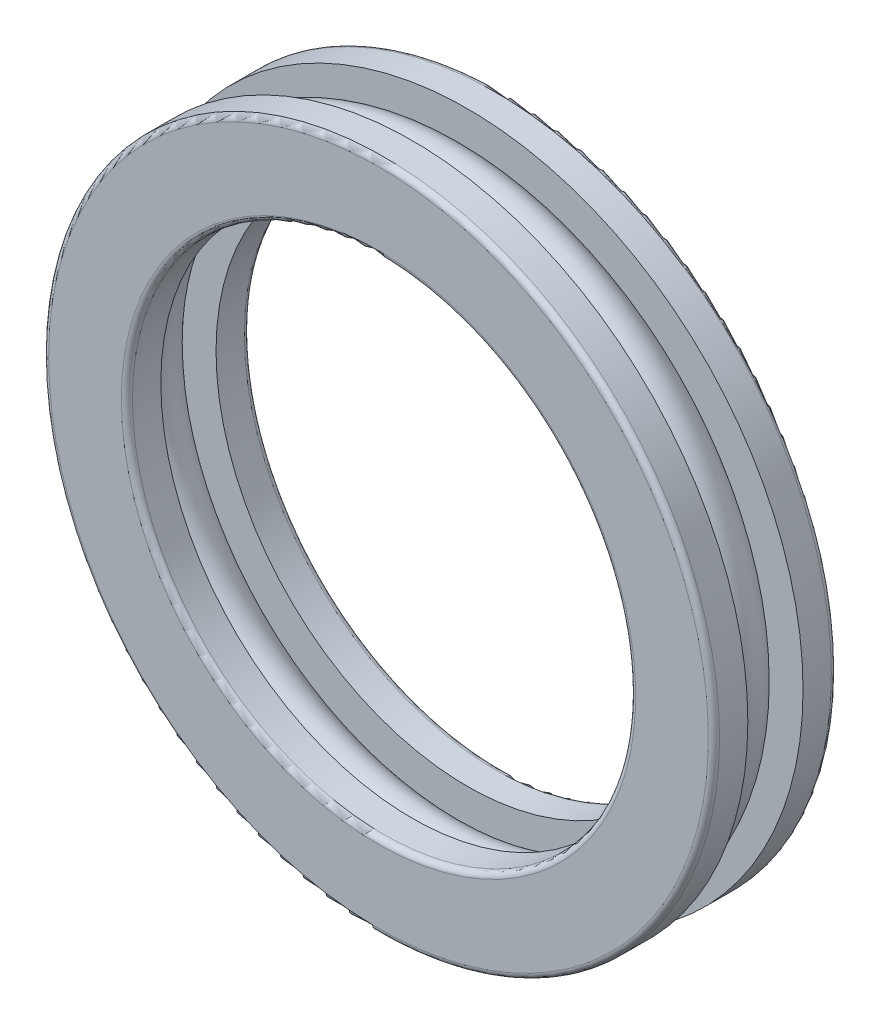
ISO-10303-21;
HEADER;
FILE_DESCRIPTION(('STEP AP214'),'2;1');
FILE_NAME('part.step','',(''),(''),'','','');
FILE_SCHEMA(('AUTOMOTIVE_DESIGN { 1 0 10303 214 1 1 1 1 }'));
ENDSEC;
DATA;
#1=APPLICATION_CONTEXT('core data for automotive mechanical design processes');
#2=APPLICATION_PROTOCOL_DEFINITION('international standard','automotive_design',2000,#1);
#3=PRODUCT_CONTEXT('',#1,'mechanical');
#4=PRODUCT('Part','Part','',(#3));
#5=PRODUCT_RELATED_PRODUCT_CATEGORY('part','',(#4));
#6=PRODUCT_DEFINITION_FORMATION('','',#4);
#7=PRODUCT_DEFINITION_CONTEXT('part definition',#1,'design');
#8=PRODUCT_DEFINITION('design','',#6,#7);
#9=PRODUCT_DEFINITION_SHAPE('','',#8);
#10=(LENGTH_UNIT() NAMED_UNIT(*) SI_UNIT(.MILLI.,.METRE.));
#11=(NAMED_UNIT(*) PLANE_ANGLE_UNIT() SI_UNIT($,.RADIAN.));
#12=(NAMED_UNIT(*) SI_UNIT($,.STERADIAN.) SOLID_ANGLE_UNIT());
#13=UNCERTAINTY_MEASURE_WITH_UNIT(LENGTH_MEASURE(1.E-05),#10,'distance_accuracy_value','');
#14=(GEOMETRIC_REPRESENTATION_CONTEXT(3) GLOBAL_UNCERTAINTY_ASSIGNED_CONTEXT((#13)) GLOBAL_UNIT_ASSIGNED_CONTEXT((#10,
#11,#12)) REPRESENTATION_CONTEXT('',''));
#15=CARTESIAN_POINT('',(0.,0.,0.));
#16=DIRECTION('',(0.,0.,1.));
#17=DIRECTION('',(1.,0.,0.));
#18=AXIS2_PLACEMENT_3D('',#15,#16,#17);
#19=CARTESIAN_POINT('',(0.,0.,-11.));
#20=DIRECTION('',(0.,0.,1.));
#21=DIRECTION('',(1.,0.,0.));
#22=AXIS2_PLACEMENT_3D('',#19,#20,#21);
#23=TOROIDAL_SURFACE('',#22,52.5,4.51903390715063);
#24=CARTESIAN_POINT('',(57.0190339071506,0.,-11.));
#25=VERTEX_POINT('',#24);
#26=VERTEX_LOOP('',#25);
#27=FACE_BOUND('',#26,.T.);
#28=ADVANCED_FACE('F39',(#27),#23,.T.);
#29=CLOSED_SHELL('',(#28));
#30=MANIFOLD_SOLID_BREP('B2',#29);
#31=CARTESIAN_POINT('',(0.,0.,0.));
#32=DIRECTION('',(0.,0.,1.));
#33=DIRECTION('',(1.,0.,0.));
#34=AXIS2_PLACEMENT_3D('',#31,#32,#33);
#35=CYLINDRICAL_SURFACE('',#34,60.);
#36=CARTESIAN_POINT('',(0.,0.,-21.));
#37=DIRECTION('',(0.,0.,1.));
#38=DIRECTION('',(1.,0.,0.));
#39=AXIS2_PLACEMENT_3D('',#36,#37,#38);
#40=CIRCLE('',#39,60.);
#41=CARTESIAN_POINT('',(60.,0.,-21.));
#42=VERTEX_POINT('',#41);
#43=EDGE_CURVE('E38',#42,#42,#40,.T.);
#44=ORIENTED_EDGE('',*,*,#43,.T.);
#45=EDGE_LOOP('',(#44));
#46=FACE_BOUND('',#45,.T.);
#47=CARTESIAN_POINT('',(0.,0.,-15.9376947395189));
#48=DIRECTION('',(0.,0.,1.));
#49=DIRECTION('',(1.,0.,0.));
#50=AXIS2_PLACEMENT_3D('',#47,#48,#49);
#51=CIRCLE('',#50,60.);
#52=CARTESIAN_POINT('',(60.,0.,-15.9376947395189));
#53=VERTEX_POINT('',#52);
#54=EDGE_CURVE('E78',#53,#53,#51,.T.);
#55=ORIENTED_EDGE('',*,*,#54,.F.);
#56=EDGE_LOOP('',(#55));
#57=FACE_BOUND('',#56,.T.);
#58=ADVANCED_FACE('F58',(#46,#57),#35,.T.);
#59=CARTESIAN_POINT('',(-60.,0.,-15.9376947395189));
#60=DIRECTION('',(0.,0.,-1.));
#61=DIRECTION('',(-1.,0.,0.));
#62=AXIS2_PLACEMENT_3D('',#59,#60,#61);
#63=PLANE('',#62);
#64=CARTESIAN_POINT('',(0.,0.,-15.9376947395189));
#65=DIRECTION('',(0.,0.,1.));
#66=DIRECTION('',(1.,0.,0.));
#67=AXIS2_PLACEMENT_3D('',#64,#65,#66);
#68=CIRCLE('',#67,45.);
#69=CARTESIAN_POINT('',(45.,0.,-15.9376947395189));
#70=VERTEX_POINT('',#69);
#71=EDGE_CURVE('E81',#70,#70,#68,.T.);
#72=ORIENTED_EDGE('',*,*,#71,.F.);
#73=EDGE_LOOP('',(#72));
#74=FACE_BOUND('',#73,.T.);
#75=ORIENTED_EDGE('',*,*,#54,.T.);
#76=EDGE_LOOP('',(#75));
#77=FACE_BOUND('',#76,.T.);
#78=ADVANCED_FACE('F87',(#74,#77),#63,.F.);
#79=CARTESIAN_POINT('',(0.,0.,0.));
#80=DIRECTION('',(0.,0.,1.));
#81=DIRECTION('',(1.,0.,0.));
#82=AXIS2_PLACEMENT_3D('',#79,#80,#81);
#83=CYLINDRICAL_SURFACE('',#82,45.);
#84=CARTESIAN_POINT('',(0.,0.,-21.));
#85=DIRECTION('',(0.,0.,1.));
#86=DIRECTION('',(1.,0.,0.));
#87=AXIS2_PLACEMENT_3D('',#84,#85,#86);
#88=CIRCLE('',#87,45.);
#89=CARTESIAN_POINT('',(45.,0.,-21.));
#90=VERTEX_POINT('',#89);
#91=EDGE_CURVE('E65',#90,#90,#88,.F.);
#92=ORIENTED_EDGE('',*,*,#91,.T.);
#93=EDGE_LOOP('',(#92));
#94=FACE_BOUND('',#93,.T.);
#95=ORIENTED_EDGE('',*,*,#71,.T.);
#96=EDGE_LOOP('',(#95));
#97=FACE_BOUND('',#96,.T.);
#98=ADVANCED_FACE('F85',(#94,#97),#83,.F.);
#99=CARTESIAN_POINT('',(-60.,0.,-22.));
#100=DIRECTION('',(0.,0.,1.));
#101=DIRECTION('',(1.,0.,0.));
#102=AXIS2_PLACEMENT_3D('',#99,#100,#101);
#103=PLANE('',#102);
#104=CARTESIAN_POINT('',(0.,0.,-22.));
#105=DIRECTION('',(0.,0.,1.));
#106=DIRECTION('',(1.,0.,0.));
#107=AXIS2_PLACEMENT_3D('',#104,#105,#106);
#108=CIRCLE('',#107,46.);
#109=CARTESIAN_POINT('',(46.,0.,-22.));
#110=VERTEX_POINT('',#109);
#111=EDGE_CURVE('E69',#110,#110,#108,.T.);
#112=ORIENTED_EDGE('',*,*,#111,.T.);
#113=EDGE_LOOP('',(#112));
#114=FACE_BOUND('',#113,.T.);
#115=CARTESIAN_POINT('',(0.,0.,-22.));
#116=DIRECTION('',(0.,0.,1.));
#117=DIRECTION('',(1.,0.,0.));
#118=AXIS2_PLACEMENT_3D('',#115,#116,#117);
#119=CIRCLE('',#118,59.);
#120=CARTESIAN_POINT('',(59.,0.,-22.));
#121=VERTEX_POINT('',#120);
#122=EDGE_CURVE('E73',#121,#121,#119,.F.);
#123=ORIENTED_EDGE('',*,*,#122,.T.);
#124=EDGE_LOOP('',(#123));
#125=FACE_BOUND('',#124,.T.);
#126=ADVANCED_FACE('F100',(#114,#125),#103,.F.);
#127=CARTESIAN_POINT('',(0.,0.,-21.));
#128=DIRECTION('',(0.,0.,1.));
#129=DIRECTION('',(1.,0.,0.));
#130=AXIS2_PLACEMENT_3D('',#127,#128,#129);
#131=TOROIDAL_SURFACE('',#130,46.,1.);
#132=ORIENTED_EDGE('',*,*,#91,.F.);
#133=EDGE_LOOP('',(#132));
#134=FACE_BOUND('',#133,.T.);
#135=ORIENTED_EDGE('',*,*,#111,.F.);
#136=EDGE_LOOP('',(#135));
#137=FACE_BOUND('',#136,.T.);
#138=ADVANCED_FACE('F98',(#134,#137),#131,.T.);
#139=CARTESIAN_POINT('',(0.,0.,-21.));
#140=DIRECTION('',(0.,0.,1.));
#141=DIRECTION('',(1.,0.,0.));
#142=AXIS2_PLACEMENT_3D('',#139,#140,#141);
#143=TOROIDAL_SURFACE('',#142,59.,1.);
#144=ORIENTED_EDGE('',*,*,#122,.F.);
#145=EDGE_LOOP('',(#144));
#146=FACE_BOUND('',#145,.T.);
#147=ORIENTED_EDGE('',*,*,#43,.F.);
#148=EDGE_LOOP('',(#147));
#149=FACE_BOUND('',#148,.T.);
#150=ADVANCED_FACE('F60',(#146,#149),#143,.T.);
#151=CLOSED_SHELL('',(#58,#78,#98,#126,#138,#150));
#152=MANIFOLD_SOLID_BREP('B6',#151);
#153=CARTESIAN_POINT('',(0.,0.,0.));
#154=DIRECTION('',(0.,0.,1.));
#155=DIRECTION('',(1.,0.,0.));
#156=AXIS2_PLACEMENT_3D('',#153,#154,#155);
#157=CYLINDRICAL_SURFACE('',#156,60.);
#158=CARTESIAN_POINT('',(0.,0.,-1.));
#159=DIRECTION('',(0.,0.,-1.));
#160=DIRECTION('',(-1.,0.,0.));
#161=AXIS2_PLACEMENT_3D('',#158,#159,#160);
#162=CIRCLE('',#161,60.);
#163=CARTESIAN_POINT('',(-60.,0.,-1.));
#164=VERTEX_POINT('',#163);
#165=EDGE_CURVE('E156',#164,#164,#162,.T.);
#166=ORIENTED_EDGE('',*,*,#165,.T.);
#167=EDGE_LOOP('',(#166));
#168=FACE_BOUND('',#167,.T.);
#169=CARTESIAN_POINT('',(0.,0.,-6.06230526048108));
#170=DIRECTION('',(0.,0.,1.));
#171=DIRECTION('',(1.,0.,0.));
#172=AXIS2_PLACEMENT_3D('',#169,#170,#171);
#173=CIRCLE('',#172,60.);
#174=CARTESIAN_POINT('',(60.,0.,-6.06230526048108));
#175=VERTEX_POINT('',#174);
#176=EDGE_CURVE('E169',#175,#175,#173,.T.);
#177=ORIENTED_EDGE('',*,*,#176,.T.);
#178=EDGE_LOOP('',(#177));
#179=FACE_BOUND('',#178,.T.);
#180=ADVANCED_FACE('F149',(#168,#179),#157,.T.);
#181=CARTESIAN_POINT('',(-60.,0.,-6.06230526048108));
#182=DIRECTION('',(0.,0.,1.));
#183=DIRECTION('',(1.,0.,0.));
#184=AXIS2_PLACEMENT_3D('',#181,#182,#183);
#185=PLANE('',#184);
#186=ORIENTED_EDGE('',*,*,#176,.F.);
#187=EDGE_LOOP('',(#186));
#188=FACE_BOUND('',#187,.T.);
#189=CARTESIAN_POINT('',(0.,0.,-6.06230526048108));
#190=DIRECTION('',(0.,0.,1.));
#191=DIRECTION('',(1.,0.,0.));
#192=AXIS2_PLACEMENT_3D('',#189,#190,#191);
#193=CIRCLE('',#192,45.);
#194=CARTESIAN_POINT('',(45.,0.,-6.06230526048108));
#195=VERTEX_POINT('',#194);
#196=EDGE_CURVE('E172',#195,#195,#193,.T.);
#197=ORIENTED_EDGE('',*,*,#196,.T.);
#198=EDGE_LOOP('',(#197));
#199=FACE_BOUND('',#198,.T.);
#200=ADVANCED_FACE('F176',(#188,#199),#185,.F.);
#201=CARTESIAN_POINT('',(0.,0.,0.));
#202=DIRECTION('',(0.,0.,1.));
#203=DIRECTION('',(1.,0.,0.));
#204=AXIS2_PLACEMENT_3D('',#201,#202,#203);
#205=CYLINDRICAL_SURFACE('',#204,45.);
#206=CARTESIAN_POINT('',(0.,0.,-1.));
#207=DIRECTION('',(0.,0.,-1.));
#208=DIRECTION('',(-1.,0.,0.));
#209=AXIS2_PLACEMENT_3D('',#206,#207,#208);
#210=CIRCLE('',#209,45.);
#211=CARTESIAN_POINT('',(-45.,0.,-1.));
#212=VERTEX_POINT('',#211);
#213=EDGE_CURVE('E57',#212,#212,#210,.F.);
#214=ORIENTED_EDGE('',*,*,#213,.T.);
#215=EDGE_LOOP('',(#214));
#216=FACE_BOUND('',#215,.T.);
#217=ORIENTED_EDGE('',*,*,#196,.F.);
#218=EDGE_LOOP('',(#217));
#219=FACE_BOUND('',#218,.T.);
#220=ADVANCED_FACE('F178',(#216,#219),#205,.F.);
#221=CARTESIAN_POINT('',(-60.,0.,0.));
#222=DIRECTION('',(0.,0.,-1.));
#223=DIRECTION('',(-1.,0.,0.));
#224=AXIS2_PLACEMENT_3D('',#221,#222,#223);
#225=PLANE('',#224);
#226=CARTESIAN_POINT('',(0.,0.,0.));
#227=DIRECTION('',(0.,0.,-1.));
#228=DIRECTION('',(-1.,0.,0.));
#229=AXIS2_PLACEMENT_3D('',#226,#227,#228);
#230=CIRCLE('',#229,59.);
#231=CARTESIAN_POINT('',(-59.,0.,0.));
#232=VERTEX_POINT('',#231);
#233=EDGE_CURVE('E160',#232,#232,#230,.F.);
#234=ORIENTED_EDGE('',*,*,#233,.T.);
#235=EDGE_LOOP('',(#234));
#236=FACE_BOUND('',#235,.T.);
#237=CARTESIAN_POINT('',(0.,0.,0.));
#238=DIRECTION('',(0.,0.,-1.));
#239=DIRECTION('',(-1.,0.,0.));
#240=AXIS2_PLACEMENT_3D('',#237,#238,#239);
#241=CIRCLE('',#240,46.);
#242=CARTESIAN_POINT('',(-46.,0.,0.));
#243=VERTEX_POINT('',#242);
#244=EDGE_CURVE('E164',#243,#243,#241,.T.);
#245=ORIENTED_EDGE('',*,*,#244,.T.);
#246=EDGE_LOOP('',(#245));
#247=FACE_BOUND('',#246,.T.);
#248=ADVANCED_FACE('F180',(#236,#247),#225,.F.);
#249=CARTESIAN_POINT('',(0.,0.,-1.));
#250=DIRECTION('',(0.,0.,-1.));
#251=DIRECTION('',(-1.,0.,0.));
#252=AXIS2_PLACEMENT_3D('',#249,#250,#251);
#253=TOROIDAL_SURFACE('',#252,59.,1.);
#254=ORIENTED_EDGE('',*,*,#165,.F.);
#255=EDGE_LOOP('',(#254));
#256=FACE_BOUND('',#255,.T.);
#257=ORIENTED_EDGE('',*,*,#233,.F.);
#258=EDGE_LOOP('',(#257));
#259=FACE_BOUND('',#258,.T.);
#260=ADVANCED_FACE('F186',(#256,#259),#253,.T.);
#261=CARTESIAN_POINT('',(0.,0.,-1.));
#262=DIRECTION('',(0.,0.,-1.));
#263=DIRECTION('',(-1.,0.,0.));
#264=AXIS2_PLACEMENT_3D('',#261,#262,#263);
#265=TOROIDAL_SURFACE('',#264,46.,1.);
#266=ORIENTED_EDGE('',*,*,#244,.F.);
#267=EDGE_LOOP('',(#266));
#268=FACE_BOUND('',#267,.T.);
#269=ORIENTED_EDGE('',*,*,#213,.F.);
#270=EDGE_LOOP('',(#269));
#271=FACE_BOUND('',#270,.T.);
#272=ADVANCED_FACE('F151',(#268,#271),#265,.T.);
#273=CLOSED_SHELL('',(#180,#200,#220,#248,#260,#272));
#274=MANIFOLD_SOLID_BREP('B33',#273);
#275=ADVANCED_BREP_SHAPE_REPRESENTATION('',(#18,#30,#152,#274),#14);
#276=SHAPE_DEFINITION_REPRESENTATION(#9,#275);
ENDSEC;
END-ISO-10303-21;
